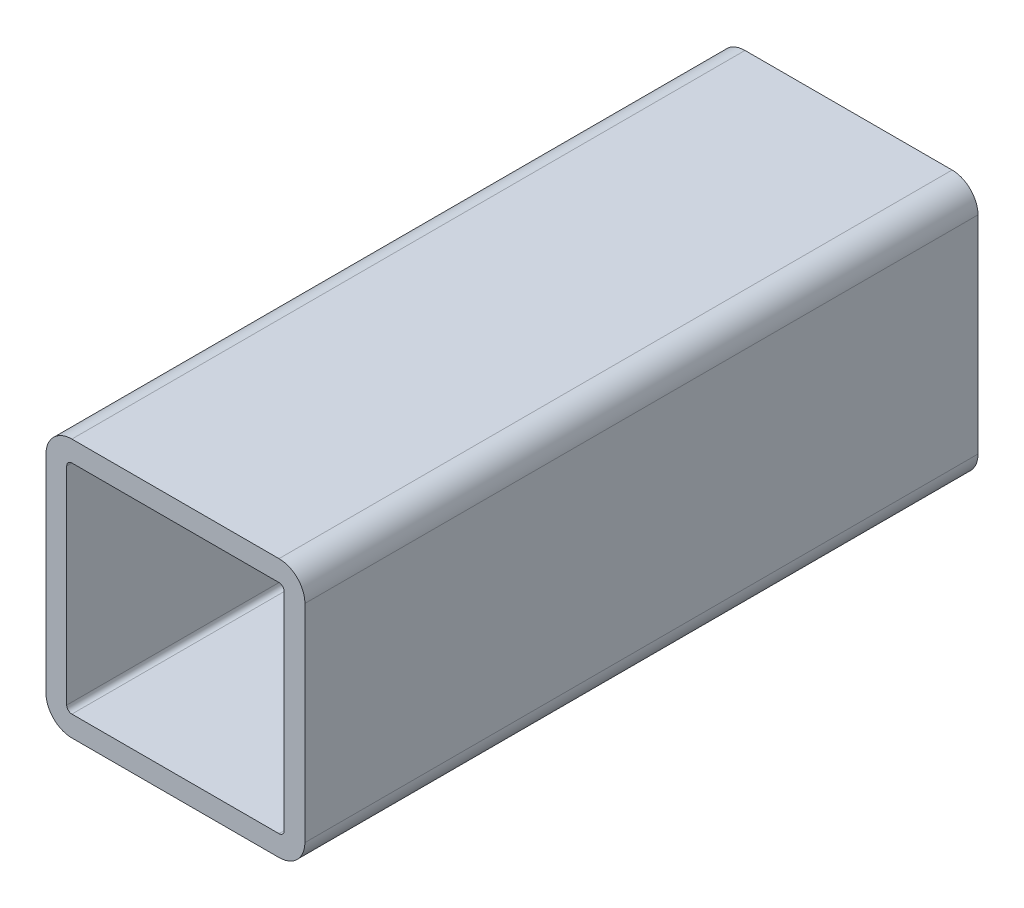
from build123d import *

# Parameters (mm, degrees)
BASE_EXTRUSION_DEPTH = 130


with BuildPart() as part:
    # Esquisse1 → Base-Extrusion (new body)
    with BuildSketch(Plane.XY):
        with BuildLine():
            Line((5, 0), (45, 0))
            ThreePointArc((45, 0), (48.535533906, -1.464466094), (50, -5))
            Line((50, -5), (50, -45))
            ThreePointArc((50, -45), (48.535533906, -48.535533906), (45, -50))
            Line((45, -50), (5, -50))
            ThreePointArc((5, -50), (1.464466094, -48.535533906), (0, -45))
            Line((0, -45), (0, -5))
            ThreePointArc((0, -5), (1.464466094, -1.464466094), (5, 0))
        make_face()
        with BuildLine():
            Line((4, -5), (4, -45))
            ThreePointArc((4, -45), (4.292893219, -45.707106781), (5, -46))
            Line((5, -46), (45, -46))
            ThreePointArc((45, -46), (45.707106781, -45.707106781), (46, -45))
            Line((46, -45), (46, -5))
            ThreePointArc((46, -5), (45.707106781, -4.292893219), (45, -4))
            Line((45, -4), (5, -4))
            ThreePointArc((5, -4), (4.292893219, -4.292893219), (4, -5))
        make_face(mode=Mode.SUBTRACT)
    extrude(amount=BASE_EXTRUSION_DEPTH)


solid = part.part
